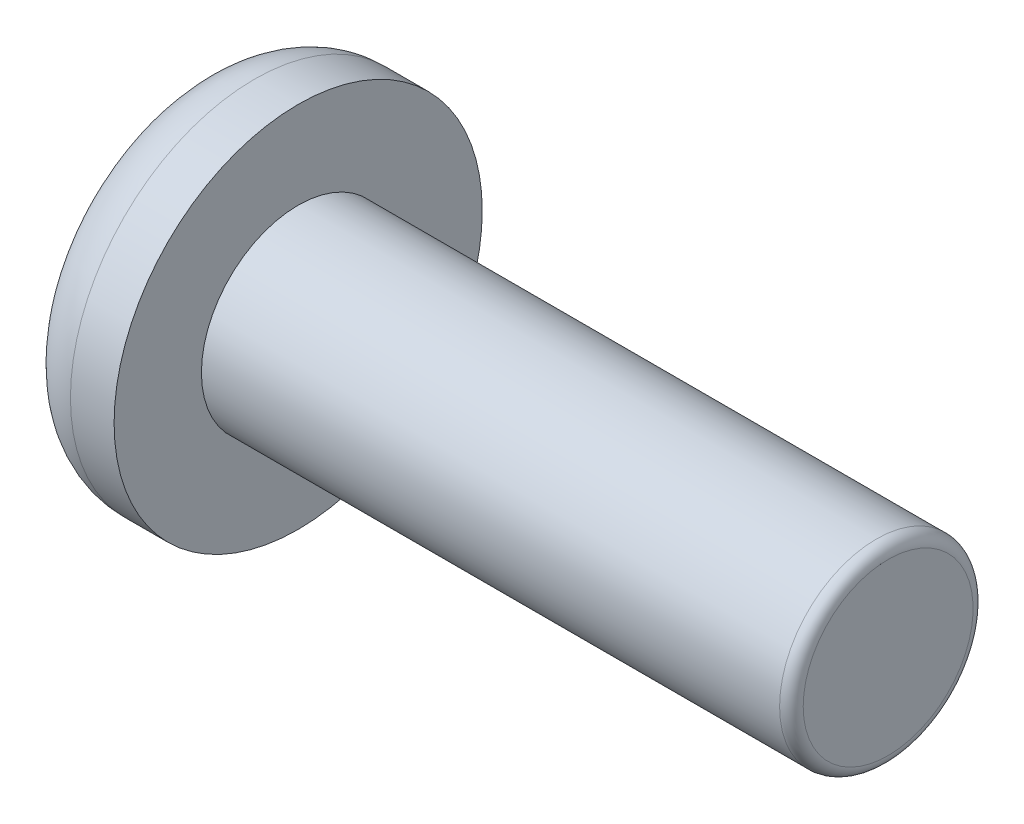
ISO-10303-21;
HEADER;
FILE_DESCRIPTION(('STEP AP214'),'2;1');
FILE_NAME('part.step','',(''),(''),'','','');
FILE_SCHEMA(('AUTOMOTIVE_DESIGN { 1 0 10303 214 1 1 1 1 }'));
ENDSEC;
DATA;
#1=APPLICATION_CONTEXT('core data for automotive mechanical design processes');
#2=APPLICATION_PROTOCOL_DEFINITION('international standard','automotive_design',2000,#1);
#3=PRODUCT_CONTEXT('',#1,'mechanical');
#4=PRODUCT('Part','Part','',(#3));
#5=PRODUCT_RELATED_PRODUCT_CATEGORY('part','',(#4));
#6=PRODUCT_DEFINITION_FORMATION('','',#4);
#7=PRODUCT_DEFINITION_CONTEXT('part definition',#1,'design');
#8=PRODUCT_DEFINITION('design','',#6,#7);
#9=PRODUCT_DEFINITION_SHAPE('','',#8);
#10=(LENGTH_UNIT() NAMED_UNIT(*) SI_UNIT(.MILLI.,.METRE.));
#11=(NAMED_UNIT(*) PLANE_ANGLE_UNIT() SI_UNIT($,.RADIAN.));
#12=(NAMED_UNIT(*) SI_UNIT($,.STERADIAN.) SOLID_ANGLE_UNIT());
#13=UNCERTAINTY_MEASURE_WITH_UNIT(LENGTH_MEASURE(1.E-05),#10,'distance_accuracy_value','');
#14=(GEOMETRIC_REPRESENTATION_CONTEXT(3) GLOBAL_UNCERTAINTY_ASSIGNED_CONTEXT((#13)) GLOBAL_UNIT_ASSIGNED_CONTEXT((#10,
#11,#12)) REPRESENTATION_CONTEXT('',''));
#15=CARTESIAN_POINT('',(0.,0.,0.));
#16=DIRECTION('',(0.,0.,1.));
#17=DIRECTION('',(1.,0.,0.));
#18=AXIS2_PLACEMENT_3D('',#15,#16,#17);
#19=CARTESIAN_POINT('',(14.9098000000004,2.08279999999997,-1.33226762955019E-12));
#20=DIRECTION('',(-1.,0.,0.));
#21=DIRECTION('',(0.,0.,1.00000000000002));
#22=AXIS2_PLACEMENT_3D('',#19,#20,#21);
#23=PLANE('',#22);
#24=CARTESIAN_POINT('',(14.9097999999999,0.,0.));
#25=DIRECTION('',(-1.,0.,0.));
#26=DIRECTION('',(0.,0.,1.00000000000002));
#27=AXIS2_PLACEMENT_3D('',#24,#25,#26);
#28=CIRCLE('',#27,1.8288);
#29=CARTESIAN_POINT('',(14.9097999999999,0.,1.82880000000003));
#30=VERTEX_POINT('',#29);
#31=EDGE_CURVE('E11',#30,#30,#28,.F.);
#32=ORIENTED_EDGE('',*,*,#31,.T.);
#33=EDGE_LOOP('',(#32));
#34=FACE_BOUND('',#33,.T.);
#35=ADVANCED_FACE('F30',(#34),#23,.F.);
#36=CARTESIAN_POINT('',(0.,0.,1.33226762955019E-12));
#37=DIRECTION('',(-1.,0.,0.));
#38=DIRECTION('',(0.,0.,1.00000000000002));
#39=AXIS2_PLACEMENT_3D('',#36,#37,#38);
#40=CYLINDRICAL_SURFACE('',#39,2.0828);
#41=CARTESIAN_POINT('',(14.6557999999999,1.28803218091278E-13,4.44089209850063E-13));
#42=DIRECTION('',(-1.,0.,0.));
#43=DIRECTION('',(0.,0.,1.00000000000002));
#44=AXIS2_PLACEMENT_3D('',#41,#42,#43);
#45=CIRCLE('',#44,2.0828);
#46=CARTESIAN_POINT('',(14.6557999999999,1.27737358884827E-13,2.08280000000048));
#47=VERTEX_POINT('',#46);
#48=EDGE_CURVE('E37',#47,#47,#45,.T.);
#49=ORIENTED_EDGE('',*,*,#48,.T.);
#50=EDGE_LOOP('',(#49));
#51=FACE_BOUND('',#50,.T.);
#52=CARTESIAN_POINT('',(2.20979999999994,0.,1.33226762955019E-12));
#53=DIRECTION('',(-1.,0.,0.));
#54=DIRECTION('',(0.,0.,1.00000000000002));
#55=AXIS2_PLACEMENT_3D('',#52,#53,#54);
#56=CIRCLE('',#55,2.0828);
#57=CARTESIAN_POINT('',(2.20979999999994,0.,2.08280000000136));
#58=VERTEX_POINT('',#57);
#59=EDGE_CURVE('E147',#58,#58,#56,.T.);
#60=ORIENTED_EDGE('',*,*,#59,.F.);
#61=EDGE_LOOP('',(#60));
#62=FACE_BOUND('',#61,.T.);
#63=ADVANCED_FACE('F152',(#51,#62),#40,.T.);
#64=CARTESIAN_POINT('',(2.20980000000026,3.96240000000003,2.66453525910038E-12));
#65=DIRECTION('',(-1.,0.,0.));
#66=DIRECTION('',(0.,0.,1.00000000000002));
#67=AXIS2_PLACEMENT_3D('',#64,#65,#66);
#68=PLANE('',#67);
#69=CARTESIAN_POINT('',(2.20979999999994,0.,1.33226762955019E-12));
#70=DIRECTION('',(-1.,0.,0.));
#71=DIRECTION('',(0.,0.,1.00000000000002));
#72=AXIS2_PLACEMENT_3D('',#69,#70,#71);
#73=CIRCLE('',#72,3.9624);
#74=CARTESIAN_POINT('',(2.20979999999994,0.,3.9624000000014));
#75=VERTEX_POINT('',#74);
#76=EDGE_CURVE('E144',#75,#75,#73,.T.);
#77=ORIENTED_EDGE('',*,*,#76,.F.);
#78=EDGE_LOOP('',(#77));
#79=FACE_BOUND('',#78,.T.);
#80=ORIENTED_EDGE('',*,*,#59,.T.);
#81=EDGE_LOOP('',(#80));
#82=FACE_BOUND('',#81,.T.);
#83=ADVANCED_FACE('F171',(#79,#82),#68,.F.);
#84=CARTESIAN_POINT('',(0.,0.,1.33226762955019E-12));
#85=DIRECTION('',(-1.,0.,0.));
#86=DIRECTION('',(0.,0.,1.00000000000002));
#87=AXIS2_PLACEMENT_3D('',#84,#85,#86);
#88=CYLINDRICAL_SURFACE('',#87,3.9624);
#89=CARTESIAN_POINT('',(1.26999999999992,0.,1.33226762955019E-12));
#90=DIRECTION('',(-1.,0.,0.));
#91=DIRECTION('',(0.,0.,1.00000000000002));
#92=AXIS2_PLACEMENT_3D('',#89,#90,#91);
#93=CIRCLE('',#92,3.9624);
#94=CARTESIAN_POINT('',(1.26999999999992,0.,3.9624000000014));
#95=VERTEX_POINT('',#94);
#96=EDGE_CURVE('E141',#95,#95,#93,.T.);
#97=ORIENTED_EDGE('',*,*,#96,.F.);
#98=EDGE_LOOP('',(#97));
#99=FACE_BOUND('',#98,.T.);
#100=ORIENTED_EDGE('',*,*,#76,.T.);
#101=EDGE_LOOP('',(#100));
#102=FACE_BOUND('',#101,.T.);
#103=ADVANCED_FACE('F175',(#99,#102),#88,.T.);
#104=CARTESIAN_POINT('',(1.26999999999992,0.,1.33226762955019E-12));
#105=DIRECTION('',(-1.,0.,0.));
#106=DIRECTION('',(0.,0.,1.00000000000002));
#107=AXIS2_PLACEMENT_3D('',#104,#105,#106);
#108=TOROIDAL_SURFACE('',#107,2.6924,1.27);
#109=CARTESIAN_POINT('',(0.,0.,1.33226762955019E-12));
#110=DIRECTION('',(-1.,0.,0.));
#111=DIRECTION('',(0.,0.,1.00000000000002));
#112=AXIS2_PLACEMENT_3D('',#109,#110,#111);
#113=CIRCLE('',#112,2.6924);
#114=CARTESIAN_POINT('',(0.,0.,2.69240000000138));
#115=VERTEX_POINT('',#114);
#116=EDGE_CURVE('E132',#115,#115,#113,.T.);
#117=ORIENTED_EDGE('',*,*,#116,.F.);
#118=EDGE_LOOP('',(#117));
#119=FACE_BOUND('',#118,.T.);
#120=ORIENTED_EDGE('',*,*,#96,.T.);
#121=EDGE_LOOP('',(#120));
#122=FACE_BOUND('',#121,.T.);
#123=ADVANCED_FACE('F181',(#119,#122),#108,.T.);
#124=CARTESIAN_POINT('',(0.,0.,1.33226762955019E-12));
#125=DIRECTION('',(1.,0.,0.));
#126=DIRECTION('',(0.,0.,-1.00000000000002));
#127=AXIS2_PLACEMENT_3D('',#124,#125,#126);
#128=PLANE('',#127);
#129=DIRECTION('',(0.,-0.866025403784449,0.500000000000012));
#130=VECTOR('',#129,1.);
#131=CARTESIAN_POINT('',(-5.69683189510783E-11,-1.19062500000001,-0.687407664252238));
#132=LINE('',#131,#130);
#133=CARTESIAN_POINT('',(2.08166817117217E-13,0.,-1.37481532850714));
#134=VERTEX_POINT('',#133);
#135=CARTESIAN_POINT('',(-5.69683189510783E-11,-1.19062500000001,-0.687407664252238));
#136=VERTEX_POINT('',#135);
#137=EDGE_CURVE('E98',#134,#136,#132,.T.);
#138=ORIENTED_EDGE('',*,*,#137,.F.);
#139=DIRECTION('',(0.,-0.866025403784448,-0.50000000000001));
#140=VECTOR('',#139,1.);
#141=CARTESIAN_POINT('',(-5.66352520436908E-11,0.,-1.37481532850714));
#142=LINE('',#141,#140);
#143=CARTESIAN_POINT('',(-5.63576962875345E-11,1.19062499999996,-0.687407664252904));
#144=VERTEX_POINT('',#143);
#145=EDGE_CURVE('E44',#144,#134,#142,.T.);
#146=ORIENTED_EDGE('',*,*,#145,.F.);
#147=DIRECTION('',(0.,0.,-1.00000000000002));
#148=VECTOR('',#147,1.);
#149=CARTESIAN_POINT('',(-5.63576962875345E-11,1.19062499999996,-0.687407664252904));
#150=LINE('',#149,#148);
#151=CARTESIAN_POINT('',(-5.69683189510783E-11,1.19062499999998,0.68740766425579));
#152=VERTEX_POINT('',#151);
#153=EDGE_CURVE('E114',#152,#144,#150,.T.);
#154=ORIENTED_EDGE('',*,*,#153,.F.);
#155=DIRECTION('',(0.,0.866025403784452,-0.500000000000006));
#156=VECTOR('',#155,1.);
#157=CARTESIAN_POINT('',(-5.69683189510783E-11,1.19062499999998,0.68740766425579));
#158=LINE('',#157,#156);
#159=CARTESIAN_POINT('',(-5.68572966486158E-11,0.,1.37481532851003));
#160=VERTEX_POINT('',#159);
#161=EDGE_CURVE('E108',#160,#152,#158,.T.);
#162=ORIENTED_EDGE('',*,*,#161,.F.);
#163=DIRECTION('',(0.,0.866025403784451,0.500000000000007));
#164=VECTOR('',#163,1.);
#165=CARTESIAN_POINT('',(-5.68572966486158E-11,0.,1.37481532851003));
#166=LINE('',#165,#164);
#167=CARTESIAN_POINT('',(-5.70238301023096E-11,-1.190625,0.687407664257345));
#168=VERTEX_POINT('',#167);
#169=EDGE_CURVE('E106',#168,#160,#166,.T.);
#170=ORIENTED_EDGE('',*,*,#169,.F.);
#171=DIRECTION('',(0.,0.,1.00000000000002));
#172=VECTOR('',#171,1.);
#173=CARTESIAN_POINT('',(-5.70238301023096E-11,-1.190625,0.687407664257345));
#174=LINE('',#173,#172);
#175=EDGE_CURVE('E87',#136,#168,#174,.T.);
#176=ORIENTED_EDGE('',*,*,#175,.F.);
#177=EDGE_LOOP('',(#138,#146,#154,#162,#170,#176));
#178=FACE_BOUND('',#177,.T.);
#179=ORIENTED_EDGE('',*,*,#116,.T.);
#180=EDGE_LOOP('',(#179));
#181=FACE_BOUND('',#180,.T.);
#182=ADVANCED_FACE('F102',(#178,#181),#128,.F.);
#183=CARTESIAN_POINT('',(2.53999999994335,0.,-1.37481532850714));
#184=DIRECTION('',(0.,0.50000000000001,-0.86602540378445));
#185=DIRECTION('',(0.,0.866025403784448,0.50000000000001));
#186=AXIS2_PLACEMENT_3D('',#183,#184,#185);
#187=PLANE('',#186);
#188=ORIENTED_EDGE('',*,*,#145,.T.);
#189=DIRECTION('',(-1.,0.,0.));
#190=VECTOR('',#189,1.);
#191=CARTESIAN_POINT('',(2.53999999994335,0.,-1.37481532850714));
#192=LINE('',#191,#190);
#193=CARTESIAN_POINT('',(2.53999999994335,0.,-1.37481532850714));
#194=VERTEX_POINT('',#193);
#195=EDGE_CURVE('E95',#194,#134,#192,.T.);
#196=ORIENTED_EDGE('',*,*,#195,.F.);
#197=DIRECTION('',(0.,-0.866025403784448,-0.50000000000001));
#198=VECTOR('',#197,1.);
#199=CARTESIAN_POINT('',(2.53999999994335,0.,-1.37481532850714));
#200=LINE('',#199,#198);
#201=CARTESIAN_POINT('',(2.53999999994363,1.19062499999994,-0.687407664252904));
#202=VERTEX_POINT('',#201);
#203=EDGE_CURVE('E116',#202,#194,#200,.T.);
#204=ORIENTED_EDGE('',*,*,#203,.F.);
#205=DIRECTION('',(-1.,0.,0.));
#206=VECTOR('',#205,1.);
#207=CARTESIAN_POINT('',(2.53999999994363,1.19062499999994,-0.687407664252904));
#208=LINE('',#207,#206);
#209=EDGE_CURVE('E51',#202,#144,#208,.T.);
#210=ORIENTED_EDGE('',*,*,#209,.T.);
#211=EDGE_LOOP('',(#188,#196,#204,#210));
#212=FACE_BOUND('',#211,.T.);
#213=ADVANCED_FACE('F188',(#212),#187,.F.);
#214=CARTESIAN_POINT('',(2.53999999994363,1.19062499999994,-0.687407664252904));
#215=DIRECTION('',(0.,1.00000000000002,0.));
#216=DIRECTION('',(0.,0.,1.00000000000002));
#217=AXIS2_PLACEMENT_3D('',#214,#215,#216);
#218=PLANE('',#217);
#219=ORIENTED_EDGE('',*,*,#153,.T.);
#220=ORIENTED_EDGE('',*,*,#209,.F.);
#221=DIRECTION('',(0.,0.,-1.00000000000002));
#222=VECTOR('',#221,1.);
#223=CARTESIAN_POINT('',(2.53999999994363,1.19062499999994,-0.687407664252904));
#224=LINE('',#223,#222);
#225=CARTESIAN_POINT('',(2.53999999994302,1.19062499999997,0.68740766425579));
#226=VERTEX_POINT('',#225);
#227=EDGE_CURVE('E128',#226,#202,#224,.T.);
#228=ORIENTED_EDGE('',*,*,#227,.F.);
#229=DIRECTION('',(-1.,0.,0.));
#230=VECTOR('',#229,1.);
#231=CARTESIAN_POINT('',(2.53999999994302,1.19062499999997,0.68740766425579));
#232=LINE('',#231,#230);
#233=EDGE_CURVE('E133',#226,#152,#232,.T.);
#234=ORIENTED_EDGE('',*,*,#233,.T.);
#235=EDGE_LOOP('',(#219,#220,#228,#234));
#236=FACE_BOUND('',#235,.T.);
#237=ADVANCED_FACE('F191',(#236),#218,.F.);
#238=CARTESIAN_POINT('',(2.53999999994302,1.19062499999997,0.68740766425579));
#239=DIRECTION('',(0.,0.500000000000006,0.866025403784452));
#240=DIRECTION('',(0.,-0.866025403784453,0.500000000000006));
#241=AXIS2_PLACEMENT_3D('',#238,#239,#240);
#242=PLANE('',#241);
#243=ORIENTED_EDGE('',*,*,#161,.T.);
#244=ORIENTED_EDGE('',*,*,#233,.F.);
#245=DIRECTION('',(0.,0.866025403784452,-0.500000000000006));
#246=VECTOR('',#245,1.);
#247=CARTESIAN_POINT('',(2.53999999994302,1.19062499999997,0.68740766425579));
#248=LINE('',#247,#246);
#249=CARTESIAN_POINT('',(2.53999999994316,0.,1.37481532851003));
#250=VERTEX_POINT('',#249);
#251=EDGE_CURVE('E125',#250,#226,#248,.T.);
#252=ORIENTED_EDGE('',*,*,#251,.F.);
#253=DIRECTION('',(-1.,0.,0.));
#254=VECTOR('',#253,1.);
#255=CARTESIAN_POINT('',(2.53999999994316,0.,1.37481532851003));
#256=LINE('',#255,#254);
#257=EDGE_CURVE('E135',#250,#160,#256,.T.);
#258=ORIENTED_EDGE('',*,*,#257,.T.);
#259=EDGE_LOOP('',(#243,#244,#252,#258));
#260=FACE_BOUND('',#259,.T.);
#261=ADVANCED_FACE('F199',(#260),#242,.F.);
#262=CARTESIAN_POINT('',(2.53999999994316,0.,1.37481532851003));
#263=DIRECTION('',(0.,-0.500000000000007,0.866025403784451));
#264=DIRECTION('',(0.,-0.866025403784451,-0.500000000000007));
#265=AXIS2_PLACEMENT_3D('',#262,#263,#264);
#266=PLANE('',#265);
#267=ORIENTED_EDGE('',*,*,#169,.T.);
#268=ORIENTED_EDGE('',*,*,#257,.F.);
#269=DIRECTION('',(0.,0.866025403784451,0.500000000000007));
#270=VECTOR('',#269,1.);
#271=CARTESIAN_POINT('',(2.53999999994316,0.,1.37481532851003));
#272=LINE('',#271,#270);
#273=CARTESIAN_POINT('',(2.53999999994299,-1.19062500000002,0.687407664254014));
#274=VERTEX_POINT('',#273);
#275=EDGE_CURVE('E122',#274,#250,#272,.T.);
#276=ORIENTED_EDGE('',*,*,#275,.F.);
#277=DIRECTION('',(-1.,0.,0.));
#278=VECTOR('',#277,1.);
#279=CARTESIAN_POINT('',(2.53999999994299,-1.19062500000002,0.687407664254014));
#280=LINE('',#279,#278);
#281=EDGE_CURVE('E94',#274,#168,#280,.T.);
#282=ORIENTED_EDGE('',*,*,#281,.T.);
#283=EDGE_LOOP('',(#267,#268,#276,#282));
#284=FACE_BOUND('',#283,.T.);
#285=ADVANCED_FACE('F196',(#284),#266,.F.);
#286=CARTESIAN_POINT('',(2.53999999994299,-1.19062500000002,0.687407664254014));
#287=DIRECTION('',(0.,-1.00000000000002,0.));
#288=DIRECTION('',(0.,0.,-1.00000000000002));
#289=AXIS2_PLACEMENT_3D('',#286,#287,#288);
#290=PLANE('',#289);
#291=ORIENTED_EDGE('',*,*,#175,.T.);
#292=ORIENTED_EDGE('',*,*,#281,.F.);
#293=DIRECTION('',(0.,0.,1.00000000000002));
#294=VECTOR('',#293,1.);
#295=CARTESIAN_POINT('',(2.53999999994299,-1.19062500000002,0.687407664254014));
#296=LINE('',#295,#294);
#297=CARTESIAN_POINT('',(2.53999999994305,-1.19062499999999,-0.687407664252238));
#298=VERTEX_POINT('',#297);
#299=EDGE_CURVE('E90',#298,#274,#296,.T.);
#300=ORIENTED_EDGE('',*,*,#299,.F.);
#301=DIRECTION('',(-1.,0.,0.));
#302=VECTOR('',#301,1.);
#303=CARTESIAN_POINT('',(2.53999999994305,-1.19062499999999,-0.687407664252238));
#304=LINE('',#303,#302);
#305=EDGE_CURVE('E83',#298,#136,#304,.T.);
#306=ORIENTED_EDGE('',*,*,#305,.T.);
#307=EDGE_LOOP('',(#291,#292,#300,#306));
#308=FACE_BOUND('',#307,.T.);
#309=ADVANCED_FACE('F85',(#308),#290,.F.);
#310=CARTESIAN_POINT('',(2.53999999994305,-1.19062499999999,-0.687407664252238));
#311=DIRECTION('',(0.,-0.500000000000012,-0.866025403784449));
#312=DIRECTION('',(0.,0.866025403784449,-0.500000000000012));
#313=AXIS2_PLACEMENT_3D('',#310,#311,#312);
#314=PLANE('',#313);
#315=ORIENTED_EDGE('',*,*,#137,.T.);
#316=ORIENTED_EDGE('',*,*,#305,.F.);
#317=DIRECTION('',(0.,-0.866025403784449,0.500000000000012));
#318=VECTOR('',#317,1.);
#319=CARTESIAN_POINT('',(2.53999999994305,-1.19062499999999,-0.687407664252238));
#320=LINE('',#319,#318);
#321=EDGE_CURVE('E119',#194,#298,#320,.T.);
#322=ORIENTED_EDGE('',*,*,#321,.F.);
#323=ORIENTED_EDGE('',*,*,#195,.T.);
#324=EDGE_LOOP('',(#315,#316,#322,#323));
#325=FACE_BOUND('',#324,.T.);
#326=ADVANCED_FACE('F99',(#325),#314,.F.);
#327=CARTESIAN_POINT('',(2.53999999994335,0.,-1.37481532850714));
#328=DIRECTION('',(-1.,0.,0.));
#329=DIRECTION('',(0.,0.,1.00000000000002));
#330=AXIS2_PLACEMENT_3D('',#327,#328,#329);
#331=PLANE('',#330);
#332=ORIENTED_EDGE('',*,*,#203,.T.);
#333=ORIENTED_EDGE('',*,*,#321,.T.);
#334=ORIENTED_EDGE('',*,*,#299,.T.);
#335=ORIENTED_EDGE('',*,*,#275,.T.);
#336=ORIENTED_EDGE('',*,*,#251,.T.);
#337=ORIENTED_EDGE('',*,*,#227,.T.);
#338=EDGE_LOOP('',(#332,#333,#334,#335,#336,#337));
#339=FACE_BOUND('',#338,.T.);
#340=ADVANCED_FACE('F157',(#339),#331,.T.);
#341=CARTESIAN_POINT('',(14.6557999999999,1.28803218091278E-13,4.44089209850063E-13));
#342=DIRECTION('',(-1.,0.,0.));
#343=DIRECTION('',(0.,0.,1.00000000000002));
#344=AXIS2_PLACEMENT_3D('',#341,#342,#343);
#345=TOROIDAL_SURFACE('',#344,1.8288,0.254);
#346=ORIENTED_EDGE('',*,*,#31,.F.);
#347=EDGE_LOOP('',(#346));
#348=FACE_BOUND('',#347,.T.);
#349=ORIENTED_EDGE('',*,*,#48,.F.);
#350=EDGE_LOOP('',(#349));
#351=FACE_BOUND('',#350,.T.);
#352=ADVANCED_FACE('F155',(#348,#351),#345,.T.);
#353=CLOSED_SHELL('',(#35,#63,#83,#103,#123,#182,#213,#237,#261,#285,#309,#326,#340,#352));
#354=MANIFOLD_SOLID_BREP('B2',#353);
#355=ADVANCED_BREP_SHAPE_REPRESENTATION('',(#18,#354),#14);
#356=SHAPE_DEFINITION_REPRESENTATION(#9,#355);
ENDSEC;
END-ISO-10303-21;
